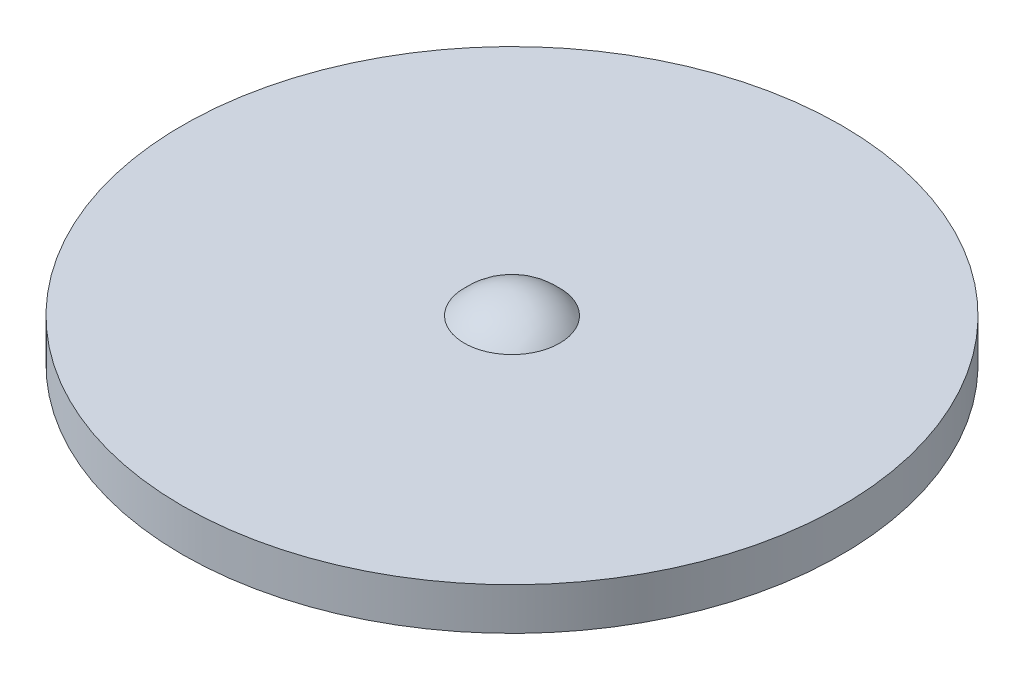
ISO-10303-21;
HEADER;
FILE_DESCRIPTION(('STEP AP214'),'2;1');
FILE_NAME('part.step','',(''),(''),'','','');
FILE_SCHEMA(('AUTOMOTIVE_DESIGN { 1 0 10303 214 1 1 1 1 }'));
ENDSEC;
DATA;
#1=APPLICATION_CONTEXT('core data for automotive mechanical design processes');
#2=APPLICATION_PROTOCOL_DEFINITION('international standard','automotive_design',2000,#1);
#3=PRODUCT_CONTEXT('',#1,'mechanical');
#4=PRODUCT('Part','Part','',(#3));
#5=PRODUCT_RELATED_PRODUCT_CATEGORY('part','',(#4));
#6=PRODUCT_DEFINITION_FORMATION('','',#4);
#7=PRODUCT_DEFINITION_CONTEXT('part definition',#1,'design');
#8=PRODUCT_DEFINITION('design','',#6,#7);
#9=PRODUCT_DEFINITION_SHAPE('','',#8);
#10=(LENGTH_UNIT() NAMED_UNIT(*) SI_UNIT(.MILLI.,.METRE.));
#11=(NAMED_UNIT(*) PLANE_ANGLE_UNIT() SI_UNIT($,.RADIAN.));
#12=(NAMED_UNIT(*) SI_UNIT($,.STERADIAN.) SOLID_ANGLE_UNIT());
#13=UNCERTAINTY_MEASURE_WITH_UNIT(LENGTH_MEASURE(1.E-05),#10,'distance_accuracy_value','');
#14=(GEOMETRIC_REPRESENTATION_CONTEXT(3) GLOBAL_UNCERTAINTY_ASSIGNED_CONTEXT((#13)) GLOBAL_UNIT_ASSIGNED_CONTEXT((#10,
#11,#12)) REPRESENTATION_CONTEXT('',''));
#15=CARTESIAN_POINT('',(0.,0.,0.));
#16=DIRECTION('',(0.,0.,1.));
#17=DIRECTION('',(1.,0.,0.));
#18=AXIS2_PLACEMENT_3D('',#15,#16,#17);
#19=CARTESIAN_POINT('',(0.,-2.01627987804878,0.));
#20=DIRECTION('',(-1.,0.,0.));
#21=DIRECTION('',(0.,-1.,0.));
#22=AXIS2_PLACEMENT_3D('',#19,#20,#21);
#23=SPHERICAL_SURFACE('',#22,3.05767987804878);
#24=CARTESIAN_POINT('',(-2.2987,0.,0.));
#25=CARTESIAN_POINT('',(-2.29869961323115,0.,0.0645402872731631));
#26=CARTESIAN_POINT('',(-2.2959794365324,0.,0.129092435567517));
#27=CARTESIAN_POINT('',(-2.28511641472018,0.,0.25775063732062));
#28=CARTESIAN_POINT('',(-2.27697196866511,0.,0.321856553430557));
#29=CARTESIAN_POINT('',(-2.25529705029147,0.,0.449262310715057));
#30=CARTESIAN_POINT('',(-2.24175802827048,0.,0.512560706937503));
#31=CARTESIAN_POINT('',(-2.20938728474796,0.,0.637827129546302));
#32=CARTESIAN_POINT('',(-2.19055126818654,0.,0.699794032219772));
#33=CARTESIAN_POINT('',(-2.12635814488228,0.,0.882768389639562));
#34=CARTESIAN_POINT('',(-2.07326323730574,0.,1.00115742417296));
#35=CARTESIAN_POINT('',(-1.9479230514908,0.,1.2273280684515));
#36=CARTESIAN_POINT('',(-1.87567704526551,0.,1.33510927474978));
#37=CARTESIAN_POINT('',(-1.75458947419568,0.,1.48648350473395));
#38=CARTESIAN_POINT('',(-1.71207522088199,0.,1.53525383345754));
#39=CARTESIAN_POINT('',(-1.62312286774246,0.,1.62900602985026));
#40=CARTESIAN_POINT('',(-1.57668859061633,0.,1.67399150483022));
#41=CARTESIAN_POINT('',(-1.48017319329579,0.,1.75991047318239));
#42=CARTESIAN_POINT('',(-1.43009043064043,0.,1.80084212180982));
#43=CARTESIAN_POINT('',(-1.32665933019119,0.,1.87834495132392));
#44=CARTESIAN_POINT('',(-1.2733102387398,0.,1.91491512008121));
#45=CARTESIAN_POINT('',(-1.10894518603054,0.,2.01765084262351));
#46=CARTESIAN_POINT('',(-0.993509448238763,0.,2.07693224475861));
#47=CARTESIAN_POINT('',(-0.754386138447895,0.,2.17523752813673));
#48=CARTESIAN_POINT('',(-0.630698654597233,0.,2.21426162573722));
#49=CARTESIAN_POINT('',(-0.378511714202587,0.,2.27100104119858));
#50=CARTESIAN_POINT('',(-0.250012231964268,0.,2.2887162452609));
#51=CARTESIAN_POINT('',(0.00813683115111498,0.,2.30231665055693));
#52=CARTESIAN_POINT('',(0.13778641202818,0.,2.29820185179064));
#53=CARTESIAN_POINT('',(0.394539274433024,0.,2.26827557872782));
#54=CARTESIAN_POINT('',(0.521642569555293,0.,2.24246422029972));
#55=CARTESIAN_POINT('',(0.769771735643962,0.,2.16982949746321));
#56=CARTESIAN_POINT('',(0.890797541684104,0.,2.12300590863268));
#57=CARTESIAN_POINT('',(1.06504784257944,0.,2.03810990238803));
#58=CARTESIAN_POINT('',(1.12194428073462,0.,2.00734794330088));
#59=CARTESIAN_POINT('',(1.23294655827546,0.,1.94114238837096));
#60=CARTESIAN_POINT('',(1.28705304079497,0.,1.90569987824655));
#61=CARTESIAN_POINT('',(1.39206224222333,0.,1.83039809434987));
#62=CARTESIAN_POINT('',(1.44296640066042,0.,1.79054082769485));
#63=CARTESIAN_POINT('',(1.54127751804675,0.,1.70665447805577));
#64=CARTESIAN_POINT('',(1.58868105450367,0.,1.66262140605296));
#65=CARTESIAN_POINT('',(1.72500424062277,0.,1.52480868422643));
#66=CARTESIAN_POINT('',(1.80817562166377,0.,1.42521553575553));
#67=CARTESIAN_POINT('',(1.95658726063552,0.,1.21346731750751));
#68=CARTESIAN_POINT('',(2.0218282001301,0.,1.10131272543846));
#69=CARTESIAN_POINT('',(2.10489234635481,0.,0.926096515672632));
#70=CARTESIAN_POINT('',(2.13013538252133,0.,0.866451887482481));
#71=CARTESIAN_POINT('',(2.17548954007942,0.,0.74528034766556));
#72=CARTESIAN_POINT('',(2.19560481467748,0.,0.68375500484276));
#73=CARTESIAN_POINT('',(2.23054715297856,0.,0.559332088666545));
#74=CARTESIAN_POINT('',(2.24538256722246,0.,0.496436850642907));
#75=CARTESIAN_POINT('',(2.26970446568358,0.,0.369632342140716));
#76=CARTESIAN_POINT('',(2.27919252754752,0.,0.305723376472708));
#77=CARTESIAN_POINT('',(2.29021305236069,0.,0.201429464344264));
#78=CARTESIAN_POINT('',(2.29339465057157,0.,0.161211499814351));
#79=CARTESIAN_POINT('',(2.29763824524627,0.,0.0806639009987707));
#80=CARTESIAN_POINT('',(2.29870024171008,0.,0.0403342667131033));
#81=CARTESIAN_POINT('',(2.29869961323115,0.,-0.0645402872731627));
#82=CARTESIAN_POINT('',(2.2959794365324,0.,-0.129092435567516));
#83=CARTESIAN_POINT('',(2.28511641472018,0.,-0.257750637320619));
#84=CARTESIAN_POINT('',(2.27697196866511,0.,-0.321856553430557));
#85=CARTESIAN_POINT('',(2.25529705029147,0.,-0.449262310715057));
#86=CARTESIAN_POINT('',(2.24175802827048,0.,-0.512560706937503));
#87=CARTESIAN_POINT('',(2.20938728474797,0.,-0.637827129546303));
#88=CARTESIAN_POINT('',(2.19055126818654,0.,-0.699794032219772));
#89=CARTESIAN_POINT('',(2.12635814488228,0.,-0.882768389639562));
#90=CARTESIAN_POINT('',(2.07326323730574,0.,-1.00115742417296));
#91=CARTESIAN_POINT('',(1.9479230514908,0.,-1.2273280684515));
#92=CARTESIAN_POINT('',(1.87567704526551,0.,-1.33510927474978));
#93=CARTESIAN_POINT('',(1.75458947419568,0.,-1.48648350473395));
#94=CARTESIAN_POINT('',(1.71207522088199,0.,-1.53525383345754));
#95=CARTESIAN_POINT('',(1.62312286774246,0.,-1.62900602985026));
#96=CARTESIAN_POINT('',(1.57668859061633,0.,-1.67399150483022));
#97=CARTESIAN_POINT('',(1.48017319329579,0.,-1.75991047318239));
#98=CARTESIAN_POINT('',(1.43009043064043,0.,-1.80084212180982));
#99=CARTESIAN_POINT('',(1.32665933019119,0.,-1.87834495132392));
#100=CARTESIAN_POINT('',(1.2733102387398,0.,-1.91491512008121));
#101=CARTESIAN_POINT('',(1.10894518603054,0.,-2.01765084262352));
#102=CARTESIAN_POINT('',(0.993509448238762,0.,-2.07693224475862));
#103=CARTESIAN_POINT('',(0.754386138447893,0.,-2.17523752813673));
#104=CARTESIAN_POINT('',(0.630698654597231,0.,-2.21426162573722));
#105=CARTESIAN_POINT('',(0.378511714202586,0.,-2.27100104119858));
#106=CARTESIAN_POINT('',(0.250012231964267,0.,-2.2887162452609));
#107=CARTESIAN_POINT('',(-0.00813683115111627,0.,-2.30231665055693));
#108=CARTESIAN_POINT('',(-0.137786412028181,0.,-2.29820185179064));
#109=CARTESIAN_POINT('',(-0.394539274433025,0.,-2.26827557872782));
#110=CARTESIAN_POINT('',(-0.521642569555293,0.,-2.24246422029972));
#111=CARTESIAN_POINT('',(-0.769771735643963,0.,-2.16982949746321));
#112=CARTESIAN_POINT('',(-0.890797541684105,0.,-2.12300590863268));
#113=CARTESIAN_POINT('',(-1.06504784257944,0.,-2.03810990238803));
#114=CARTESIAN_POINT('',(-1.12194428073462,0.,-2.00734794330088));
#115=CARTESIAN_POINT('',(-1.23294655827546,0.,-1.94114238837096));
#116=CARTESIAN_POINT('',(-1.28705304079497,0.,-1.90569987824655));
#117=CARTESIAN_POINT('',(-1.39206224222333,0.,-1.83039809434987));
#118=CARTESIAN_POINT('',(-1.44296640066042,0.,-1.79054082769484));
#119=CARTESIAN_POINT('',(-1.54127751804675,0.,-1.70665447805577));
#120=CARTESIAN_POINT('',(-1.58868105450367,0.,-1.66262140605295));
#121=CARTESIAN_POINT('',(-1.72500424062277,0.,-1.52480868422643));
#122=CARTESIAN_POINT('',(-1.80817562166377,0.,-1.42521553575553));
#123=CARTESIAN_POINT('',(-1.95658726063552,0.,-1.2134673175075));
#124=CARTESIAN_POINT('',(-2.02182820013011,0.,-1.10131272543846));
#125=CARTESIAN_POINT('',(-2.10489234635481,0.,-0.926096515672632));
#126=CARTESIAN_POINT('',(-2.13013538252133,0.,-0.866451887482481));
#127=CARTESIAN_POINT('',(-2.17548954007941,0.,-0.745280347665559));
#128=CARTESIAN_POINT('',(-2.19560481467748,0.,-0.683755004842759));
#129=CARTESIAN_POINT('',(-2.23054715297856,0.,-0.559332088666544));
#130=CARTESIAN_POINT('',(-2.24538256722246,0.,-0.496436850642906));
#131=CARTESIAN_POINT('',(-2.26970446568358,0.,-0.369632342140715));
#132=CARTESIAN_POINT('',(-2.27919252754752,0.,-0.305723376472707));
#133=CARTESIAN_POINT('',(-2.29021305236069,0.,-0.201429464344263));
#134=CARTESIAN_POINT('',(-2.29339465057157,0.,-0.16121149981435));
#135=CARTESIAN_POINT('',(-2.29763824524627,0.,-0.0806639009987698));
#136=CARTESIAN_POINT('',(-2.29870024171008,0.,-0.0403342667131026));
#137=CARTESIAN_POINT('',(-2.2987,0.,0.));
#138=B_SPLINE_CURVE_WITH_KNOTS('',3,(#24,#25,#26,#27,#28,#29,#30,#31,#32,#33,#34,#35,#36,#37,
#38,#39,#40,#41,#42,#43,#44,#45,#46,#47,#48,#49,#50,#51,#52,#53,#54,#55,#56,#57,#58,#59,#60,#61,
#62,#63,#64,#65,#66,#67,#68,#69,#70,#71,#72,#73,#74,#75,#76,#77,#78,#79,#80,#81,#82,#83,#84,#85,
#86,#87,#88,#89,#90,#91,#92,#93,#94,#95,#96,#97,#98,#99,#100,#101,#102,#103,#104,#105,#106,#107,
#108,#109,#110,#111,#112,#113,#114,#115,#116,#117,#118,#119,#120,#121,#122,#123,#124,#125,#126,
#127,#128,#129,#130,#131,#132,#133,#134,#135,#136,#137),.UNSPECIFIED.,.T.,.F.,(4,2,2,2,2,2,2,2,
2,2,2,2,2,2,2,2,2,2,2,2,2,2,2,2,2,2,2,2,2,2,2,2,2,2,2,2,2,2,2,2,2,2,2,2,2,2,2,2,2,2,2,2,2,2,2,2,
4),(0.,0.19358373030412,0.387224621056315,0.581173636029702,0.775280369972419,1.16256855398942,
1.54987146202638,1.74377667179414,1.93749492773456,2.13130093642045,2.32515183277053,
2.71244944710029,3.09974292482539,3.48703847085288,3.87433401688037,4.26162749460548,
4.64892510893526,4.84277600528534,5.03658201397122,5.23030026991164,5.42420547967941,
5.81150838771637,6.19879657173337,6.39290330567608,6.58685232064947,6.78049321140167,
6.97407694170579,7.09505653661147,7.21603613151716,7.40961986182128,7.60326075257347,
7.79720976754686,7.99131650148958,8.37860468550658,8.76590759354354,8.9598128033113,
9.15353105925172,9.3473370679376,9.54118796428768,9.92848557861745,10.3157790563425,
10.70307460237,11.0903701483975,11.4776636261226,11.8649612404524,12.0588121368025,
12.2526181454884,12.4463364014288,12.6402416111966,13.0275445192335,13.4148327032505,
13.6089394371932,13.8028884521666,13.9965293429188,14.1901130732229,14.3110926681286,
14.4320722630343),.UNSPECIFIED.);
#139=CARTESIAN_POINT('',(-2.2987,0.,0.));
#140=VERTEX_POINT('',#139);
#141=EDGE_CURVE('E23',#140,#140,#138,.T.);
#142=ORIENTED_EDGE('',*,*,#141,.T.);
#143=EDGE_LOOP('',(#142));
#144=FACE_BOUND('',#143,.T.);
#145=ADVANCED_FACE('F18',(#144),#23,.T.);
#146=CARTESIAN_POINT('',(-15.875,0.,0.));
#147=DIRECTION('',(0.,-1.,0.));
#148=DIRECTION('',(0.,0.,-1.));
#149=AXIS2_PLACEMENT_3D('',#146,#147,#148);
#150=PLANE('',#149);
#151=CARTESIAN_POINT('',(0.,0.,0.));
#152=DIRECTION('',(0.,1.,0.));
#153=DIRECTION('',(0.,0.,1.));
#154=AXIS2_PLACEMENT_3D('',#151,#152,#153);
#155=CIRCLE('',#154,15.875);
#156=CARTESIAN_POINT('',(0.,0.,15.875));
#157=VERTEX_POINT('',#156);
#158=EDGE_CURVE('E47',#157,#157,#155,.F.);
#159=ORIENTED_EDGE('',*,*,#158,.F.);
#160=EDGE_LOOP('',(#159));
#161=FACE_BOUND('',#160,.T.);
#162=ORIENTED_EDGE('',*,*,#141,.F.);
#163=EDGE_LOOP('',(#162));
#164=FACE_BOUND('',#163,.T.);
#165=ADVANCED_FACE('F41',(#161,#164),#150,.F.);
#166=CARTESIAN_POINT('',(0.,-2.01627987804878,0.));
#167=DIRECTION('',(-1.,0.,0.));
#168=DIRECTION('',(0.,-1.,0.));
#169=AXIS2_PLACEMENT_3D('',#166,#167,#168);
#170=SPHERICAL_SURFACE('',#169,1.02567987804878);
#171=CARTESIAN_POINT('',(-1.02567987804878,-2.01627987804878,0.));
#172=VERTEX_POINT('',#171);
#173=VERTEX_LOOP('',#172);
#174=FACE_BOUND('',#173,.T.);
#175=CARTESIAN_POINT('',(1.02567987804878,-2.01627987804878,0.));
#176=VERTEX_POINT('',#175);
#177=VERTEX_LOOP('',#176);
#178=FACE_BOUND('',#177,.T.);
#179=CARTESIAN_POINT('',(-1.0255594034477,-2.032,0.));
#180=CARTESIAN_POINT('',(-1.02555972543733,-2.032,0.0104834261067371));
#181=CARTESIAN_POINT('',(-1.02539887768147,-2.032,0.0209640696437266));
#182=CARTESIAN_POINT('',(-1.02378883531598,-2.03199999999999,0.0734254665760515));
#183=CARTESIAN_POINT('',(-1.01991994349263,-2.03199999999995,0.115357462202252));
#184=CARTESIAN_POINT('',(-1.00466725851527,-2.03199999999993,0.213845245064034));
#185=CARTESIAN_POINT('',(-0.991031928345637,-2.03199999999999,0.270068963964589));
#186=CARTESIAN_POINT('',(-0.963669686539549,-2.03200000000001,0.352063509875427));
#187=CARTESIAN_POINT('',(-0.953382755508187,-2.032,0.379032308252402));
#188=CARTESIAN_POINT('',(-0.930564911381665,-2.032,0.432034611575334));
#189=CARTESIAN_POINT('',(-0.91803192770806,-2.032,0.458067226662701));
#190=CARTESIAN_POINT('',(-0.877240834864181,-2.032,0.53435736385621));
#191=CARTESIAN_POINT('',(-0.845749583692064,-2.032,0.582929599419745));
#192=CARTESIAN_POINT('',(-0.775049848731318,-2.032,0.674089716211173));
#193=CARTESIAN_POINT('',(-0.735841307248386,-2.032,0.716677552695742));
#194=CARTESIAN_POINT('',(-0.672119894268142,-2.032,0.775152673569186));
#195=CARTESIAN_POINT('',(-0.650045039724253,-2.032,0.793753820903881));
#196=CARTESIAN_POINT('',(-0.604430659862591,-2.032,0.829015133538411));
#197=CARTESIAN_POINT('',(-0.580892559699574,-2.032,0.845677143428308));
#198=CARTESIAN_POINT('',(-0.508274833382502,-2.032,0.892605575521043));
#199=CARTESIAN_POINT('',(-0.457177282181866,-2.032,0.91982767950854));
#200=CARTESIAN_POINT('',(-0.351164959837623,-2.032,0.965290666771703));
#201=CARTESIAN_POINT('',(-0.296250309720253,-2.032,0.983531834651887));
#202=CARTESIAN_POINT('',(-0.18413151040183,-2.032,1.01053979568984));
#203=CARTESIAN_POINT('',(-0.126927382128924,-2.032,1.01930667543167));
#204=CARTESIAN_POINT('',(-0.0118608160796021,-2.032,1.02711121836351));
#205=CARTESIAN_POINT('',(0.0460016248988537,-2.032,1.02614883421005));
#206=CARTESIAN_POINT('',(0.160744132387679,-2.032,1.0145237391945));
#207=CARTESIAN_POINT('',(0.217624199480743,-2.032,1.00386103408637));
#208=CARTESIAN_POINT('',(0.32878668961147,-2.032,0.973137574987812));
#209=CARTESIAN_POINT('',(0.383069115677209,-2.032,0.953076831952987));
#210=CARTESIAN_POINT('',(0.487495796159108,-2.032,0.904126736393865));
#211=CARTESIAN_POINT('',(0.53764003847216,-2.032,0.875237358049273));
#212=CARTESIAN_POINT('',(0.632366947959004,-2.032,0.809450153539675));
#213=CARTESIAN_POINT('',(0.676949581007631,-2.032,0.772552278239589));
#214=CARTESIAN_POINT('',(0.759286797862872,-2.032,0.691795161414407));
#215=CARTESIAN_POINT('',(0.79704148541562,-2.032,0.647936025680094));
#216=CARTESIAN_POINT('',(0.864650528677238,-2.032,0.55450649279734));
#217=CARTESIAN_POINT('',(0.894505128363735,-2.032,0.504936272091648));
#218=CARTESIAN_POINT('',(0.945471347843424,-2.032,0.401471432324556));
#219=CARTESIAN_POINT('',(0.966582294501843,-2.032,0.347576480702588));
#220=CARTESIAN_POINT('',(0.997118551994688,-2.032,0.244903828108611));
#221=CARTESIAN_POINT('',(1.00777802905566,-2.032,0.196487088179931));
#222=CARTESIAN_POINT('',(1.02198993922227,-2.032,0.0986914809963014));
#223=CARTESIAN_POINT('',(1.02555788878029,-2.032,0.0493149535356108));
#224=CARTESIAN_POINT('',(1.02555972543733,-2.032,-0.0104834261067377));
#225=CARTESIAN_POINT('',(1.02539887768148,-2.032,-0.0209640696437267));
#226=CARTESIAN_POINT('',(1.02378883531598,-2.03199999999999,-0.0734254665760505));
#227=CARTESIAN_POINT('',(1.01991994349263,-2.03199999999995,-0.11535746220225));
#228=CARTESIAN_POINT('',(1.00466725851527,-2.03199999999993,-0.213845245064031));
#229=CARTESIAN_POINT('',(0.991031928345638,-2.03199999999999,-0.270068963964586));
#230=CARTESIAN_POINT('',(0.96366968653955,-2.03200000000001,-0.352063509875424));
#231=CARTESIAN_POINT('',(0.953382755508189,-2.032,-0.3790323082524));
#232=CARTESIAN_POINT('',(0.930564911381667,-2.032,-0.432034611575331));
#233=CARTESIAN_POINT('',(0.918031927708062,-2.032,-0.458067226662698));
#234=CARTESIAN_POINT('',(0.877240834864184,-2.032,-0.534357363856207));
#235=CARTESIAN_POINT('',(0.845749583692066,-2.032,-0.582929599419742));
#236=CARTESIAN_POINT('',(0.775049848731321,-2.032,-0.67408971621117));
#237=CARTESIAN_POINT('',(0.735841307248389,-2.032,-0.71667755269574));
#238=CARTESIAN_POINT('',(0.672119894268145,-2.032,-0.775152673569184));
#239=CARTESIAN_POINT('',(0.650045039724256,-2.032,-0.793753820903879));
#240=CARTESIAN_POINT('',(0.604430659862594,-2.032,-0.829015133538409));
#241=CARTESIAN_POINT('',(0.580892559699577,-2.032,-0.845677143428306));
#242=CARTESIAN_POINT('',(0.508274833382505,-2.032,-0.892605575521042));
#243=CARTESIAN_POINT('',(0.457177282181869,-2.032,-0.919827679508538));
#244=CARTESIAN_POINT('',(0.351164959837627,-2.032,-0.965290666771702));
#245=CARTESIAN_POINT('',(0.296250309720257,-2.032,-0.983531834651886));
#246=CARTESIAN_POINT('',(0.184131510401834,-2.032,-1.01053979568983));
#247=CARTESIAN_POINT('',(0.126927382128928,-2.032,-1.01930667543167));
#248=CARTESIAN_POINT('',(0.0118608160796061,-2.032,-1.02711121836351));
#249=CARTESIAN_POINT('',(-0.0460016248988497,-2.032,-1.02614883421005));
#250=CARTESIAN_POINT('',(-0.160744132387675,-2.032,-1.01452373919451));
#251=CARTESIAN_POINT('',(-0.217624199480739,-2.032,-1.00386103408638));
#252=CARTESIAN_POINT('',(-0.328786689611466,-2.032,-0.973137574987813));
#253=CARTESIAN_POINT('',(-0.383069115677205,-2.032,-0.953076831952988));
#254=CARTESIAN_POINT('',(-0.487495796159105,-2.032,-0.904126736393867));
#255=CARTESIAN_POINT('',(-0.537640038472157,-2.032,-0.875237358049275));
#256=CARTESIAN_POINT('',(-0.632366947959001,-2.032,-0.809450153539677));
#257=CARTESIAN_POINT('',(-0.676949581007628,-2.032,-0.772552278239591));
#258=CARTESIAN_POINT('',(-0.759286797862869,-2.032,-0.691795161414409));
#259=CARTESIAN_POINT('',(-0.797041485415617,-2.032,-0.647936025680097));
#260=CARTESIAN_POINT('',(-0.864650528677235,-2.032,-0.554506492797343));
#261=CARTESIAN_POINT('',(-0.894505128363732,-2.032,-0.504936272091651));
#262=CARTESIAN_POINT('',(-0.945471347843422,-2.032,-0.40147143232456));
#263=CARTESIAN_POINT('',(-0.966582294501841,-2.032,-0.347576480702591));
#264=CARTESIAN_POINT('',(-0.997118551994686,-2.032,-0.244903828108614));
#265=CARTESIAN_POINT('',(-1.00777802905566,-2.032,-0.196487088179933));
#266=CARTESIAN_POINT('',(-1.02198993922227,-2.032,-0.0986914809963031));
#267=CARTESIAN_POINT('',(-1.02555788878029,-2.032,-0.0493149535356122));
#268=CARTESIAN_POINT('',(-1.0255594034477,-2.032,0.));
#269=B_SPLINE_CURVE_WITH_KNOTS('',3,(#179,#180,#181,#182,#183,#184,#185,#186,#187,#188,#189,
#190,#191,#192,#193,#194,#195,#196,#197,#198,#199,#200,#201,#202,#203,#204,#205,#206,#207,#208,
#209,#210,#211,#212,#213,#214,#215,#216,#217,#218,#219,#220,#221,#222,#223,#224,#225,#226,#227,
#228,#229,#230,#231,#232,#233,#234,#235,#236,#237,#238,#239,#240,#241,#242,#243,#244,#245,#246,
#247,#248,#249,#250,#251,#252,#253,#254,#255,#256,#257,#258,#259,#260,#261,#262,#263,#264,#265,
#266,#267,#268),.UNSPECIFIED.,.T.,.F.,(4,2,2,2,2,2,2,2,2,2,2,2,2,2,2,2,2,2,2,2,2,2,2,2,2,2,2,2,
2,2,2,2,2,2,2,2,2,2,2,2,2,2,2,2,4),(0.,0.0314451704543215,0.1574490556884,0.330092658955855,
0.416598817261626,0.503185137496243,0.675975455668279,0.848767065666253,0.935277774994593,
1.02170550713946,1.19450273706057,1.36729449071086,1.54008466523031,1.71287568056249,
1.88566659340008,2.05845730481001,2.23124852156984,2.40404079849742,2.57683044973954,
2.74961476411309,2.92241237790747,3.0706579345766,3.21857876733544,3.25002393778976,
3.37602782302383,3.54867142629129,3.63517758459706,3.72176390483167,3.89455422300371,
4.06734583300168,4.15385654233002,4.24028427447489,4.413081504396,4.58587325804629,
4.75866343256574,4.93145444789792,5.10424536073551,5.27703607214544,5.44982728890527,
5.62261956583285,5.79540921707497,5.96819353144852,6.1409911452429,6.28923670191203,
6.43715753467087),.UNSPECIFIED.);
#270=CARTESIAN_POINT('',(-1.0255594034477,-2.032,0.));
#271=VERTEX_POINT('',#270);
#272=EDGE_CURVE('E32',#271,#271,#269,.T.);
#273=ORIENTED_EDGE('',*,*,#272,.F.);
#274=EDGE_LOOP('',(#273));
#275=FACE_BOUND('',#274,.T.);
#276=ADVANCED_FACE('F38',(#174,#178,#275),#170,.F.);
#277=CARTESIAN_POINT('',(0.,0.,0.));
#278=DIRECTION('',(0.,1.,0.));
#279=DIRECTION('',(0.,0.,1.));
#280=AXIS2_PLACEMENT_3D('',#277,#278,#279);
#281=CYLINDRICAL_SURFACE('',#280,15.875);
#282=CARTESIAN_POINT('',(0.,-2.032,0.));
#283=DIRECTION('',(0.,1.,0.));
#284=DIRECTION('',(0.,0.,1.));
#285=AXIS2_PLACEMENT_3D('',#282,#283,#284);
#286=CIRCLE('',#285,15.875);
#287=CARTESIAN_POINT('',(0.,-2.032,15.875));
#288=VERTEX_POINT('',#287);
#289=EDGE_CURVE('E11',#288,#288,#286,.F.);
#290=ORIENTED_EDGE('',*,*,#289,.F.);
#291=EDGE_LOOP('',(#290));
#292=FACE_BOUND('',#291,.T.);
#293=ORIENTED_EDGE('',*,*,#158,.T.);
#294=EDGE_LOOP('',(#293));
#295=FACE_BOUND('',#294,.T.);
#296=ADVANCED_FACE('F40',(#292,#295),#281,.T.);
#297=CARTESIAN_POINT('',(-15.875,-2.032,0.));
#298=DIRECTION('',(0.,-1.,0.));
#299=DIRECTION('',(0.,0.,-1.));
#300=AXIS2_PLACEMENT_3D('',#297,#298,#299);
#301=PLANE('',#300);
#302=ORIENTED_EDGE('',*,*,#289,.T.);
#303=EDGE_LOOP('',(#302));
#304=FACE_BOUND('',#303,.T.);
#305=ORIENTED_EDGE('',*,*,#272,.T.);
#306=EDGE_LOOP('',(#305));
#307=FACE_BOUND('',#306,.T.);
#308=ADVANCED_FACE('F57',(#304,#307),#301,.T.);
#309=CLOSED_SHELL('',(#145,#165,#276,#296,#308));
#310=MANIFOLD_SOLID_BREP('B1',#309);
#311=ADVANCED_BREP_SHAPE_REPRESENTATION('',(#18,#310),#14);
#312=SHAPE_DEFINITION_REPRESENTATION(#9,#311);
ENDSEC;
END-ISO-10303-21;
